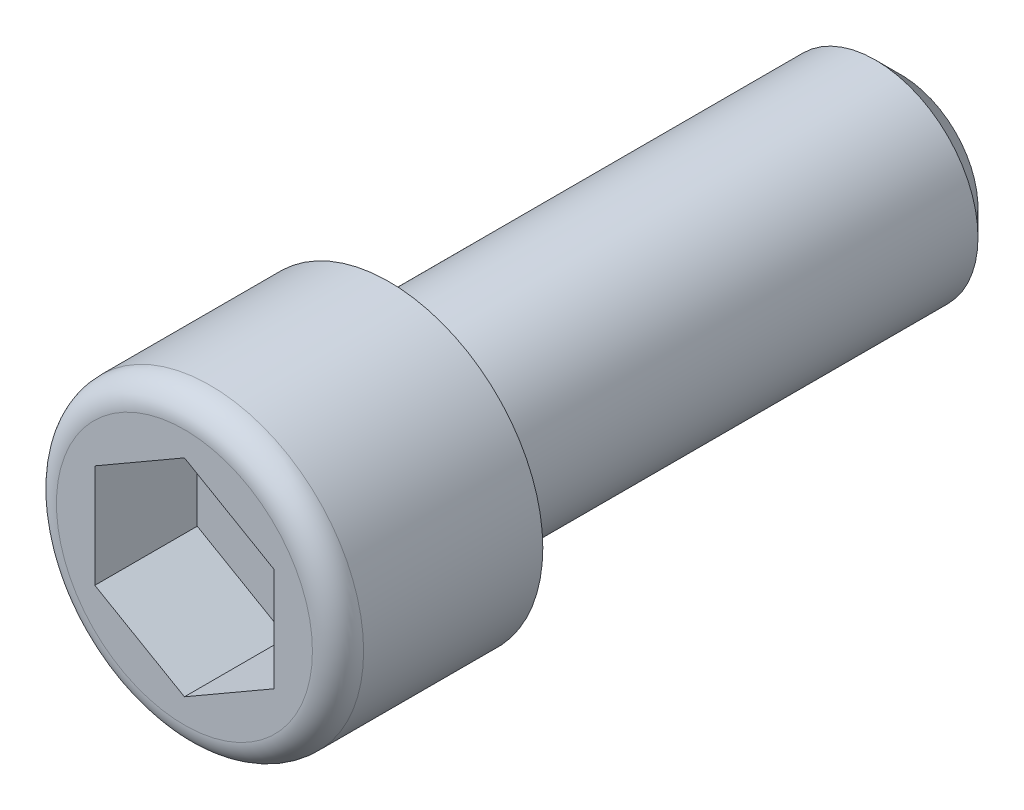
from build123d import *

# Parameters (mm, degrees)
ESQUISSE1_R             = 6
BASE_EXTRUSION_DEPTH    = 8
ESQUISSE2_R             = 4
BOSS_EXTRU_1_DEPTH      = 20
CHANFREIN1_SIZE         = 1
ENL_V_MAT_EXTRU_1_DEPTH = 4
CONG_1_R                = 1


with BuildPart() as part:
    # Esquisse1 → Base-Extrusion (new body)
    with BuildSketch(Plane.XY):
        Circle(ESQUISSE1_R)
    extrude(amount=-BASE_EXTRUSION_DEPTH)

    # Esquisse2 → Boss.-Extru.1 (add)
    with BuildSketch(Plane(origin=(0, 0, -8), x_dir=(-1, 0, 0), z_dir=(0, 0, -1))):
        with Locations(Location((0, 0, 0), (0, 0, 180))):
            Circle(ESQUISSE2_R)
    extrude(amount=BOSS_EXTRU_1_DEPTH)

    # Chanfrein1
    chanfrein1_edges = [part.edges().sort_by_distance(p)[0] for p in [
        (-4, 0, -28),
    ]]
    chamfer(chanfrein1_edges, length=CHANFREIN1_SIZE)

    # Esquisse3 → Enl_v. mat.-Extru.1 (cut)
    with BuildSketch(Plane.XY):
        Polygon((-3.5, -2.020725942), (0, -4.041451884), (3.5, -2.020725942), (3.5, 2.020725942), (0, 4.041451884), (-3.5, 2.020725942), align=None)
    extrude(amount=-ENL_V_MAT_EXTRU_1_DEPTH, mode=Mode.SUBTRACT)

    # Cong_1
    cong_1_edges = [part.edges().sort_by_distance(p)[0] for p in [
        (-6, 0, 0),
    ]]
    fillet(cong_1_edges, radius=CONG_1_R)


solid = part.part
